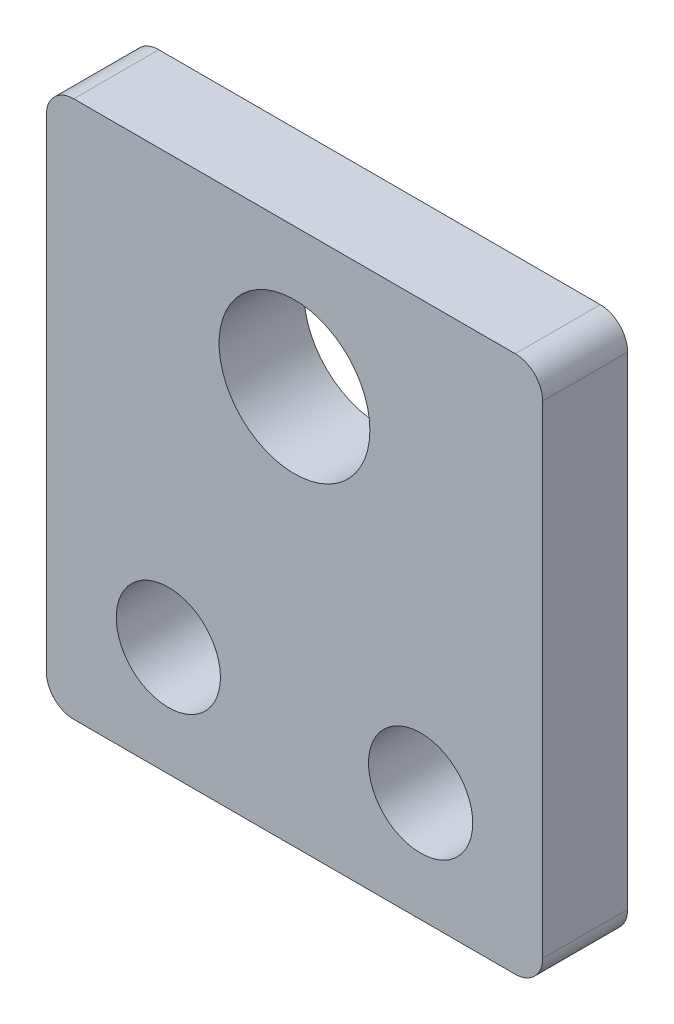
from build123d import *

# Parameters (mm, degrees)
SKETCH1_W           = 45.974
SKETCH1_H           = 49.784
BOSS_EXTRUDE1_DEPTH = 7.874
SKETCH2_R           = 4.826
SKETCH2_R_2         = 6.985
CUT_EXTRUDE1_DEPTH  = 69.220636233
FILLET1_R           = 2.54


with BuildPart() as part:
    # Sketch1 → Boss-Extrude1 (new body)
    with BuildSketch(Plane.XY):
        with Locations((22.987, 24.892)):
            Rectangle(SKETCH1_W, SKETCH1_H)
    extrude(amount=BOSS_EXTRUDE1_DEPTH)

    # Sketch2 → Cut-Extrude1 (cut, through all)
    with BuildSketch(Plane.XY.offset(7.874)):
        with Locations((34.671, 10.16)):
            Circle(SKETCH2_R)
        with Locations((11.303, 10.16)):
            Circle(SKETCH2_R)
        with Locations((22.987, 36.9062)):
            Circle(SKETCH2_R_2)
    extrude(amount=-CUT_EXTRUDE1_DEPTH, mode=Mode.SUBTRACT)

    # Fillet1
    fillet1_edges = [part.edges().sort_by_distance(p)[0] for p in [
        (0, 49.784, 3.937),
        (45.974, 49.784, 3.937),
        (45.974, 0, 3.937),
        (0, 0, 3.937),
    ]]
    fillet(fillet1_edges, radius=FILLET1_R)


solid = part.part
